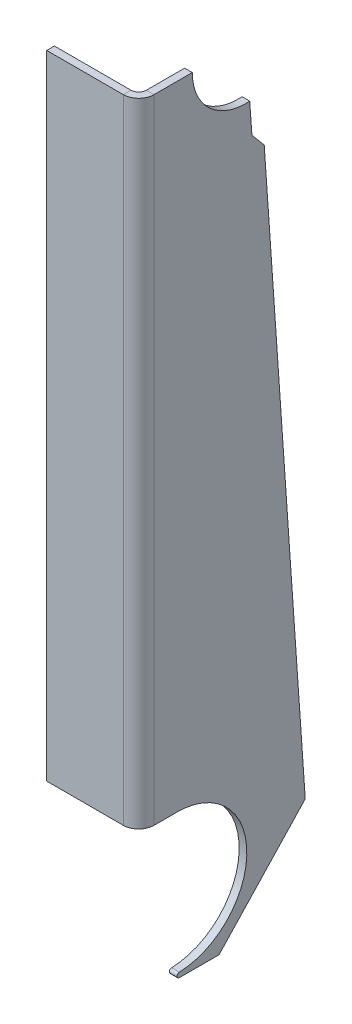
ISO-10303-21;
HEADER;
FILE_DESCRIPTION(('STEP AP214'),'2;1');
FILE_NAME('part.step','',(''),(''),'','','');
FILE_SCHEMA(('AUTOMOTIVE_DESIGN { 1 0 10303 214 1 1 1 1 }'));
ENDSEC;
DATA;
#1=APPLICATION_CONTEXT('core data for automotive mechanical design processes');
#2=APPLICATION_PROTOCOL_DEFINITION('international standard','automotive_design',2000,#1);
#3=PRODUCT_CONTEXT('',#1,'mechanical');
#4=PRODUCT('Part','Part','',(#3));
#5=PRODUCT_RELATED_PRODUCT_CATEGORY('part','',(#4));
#6=PRODUCT_DEFINITION_FORMATION('','',#4);
#7=PRODUCT_DEFINITION_CONTEXT('part definition',#1,'design');
#8=PRODUCT_DEFINITION('design','',#6,#7);
#9=PRODUCT_DEFINITION_SHAPE('','',#8);
#10=(LENGTH_UNIT() NAMED_UNIT(*) SI_UNIT(.MILLI.,.METRE.));
#11=(NAMED_UNIT(*) PLANE_ANGLE_UNIT() SI_UNIT($,.RADIAN.));
#12=(NAMED_UNIT(*) SI_UNIT($,.STERADIAN.) SOLID_ANGLE_UNIT());
#13=UNCERTAINTY_MEASURE_WITH_UNIT(LENGTH_MEASURE(1.E-05),#10,'distance_accuracy_value','');
#14=(GEOMETRIC_REPRESENTATION_CONTEXT(3) GLOBAL_UNCERTAINTY_ASSIGNED_CONTEXT((#13)) GLOBAL_UNIT_ASSIGNED_CONTEXT((#10,
#11,#12)) REPRESENTATION_CONTEXT('',''));
#15=CARTESIAN_POINT('',(0.,0.,0.));
#16=DIRECTION('',(0.,0.,1.));
#17=DIRECTION('',(1.,0.,0.));
#18=AXIS2_PLACEMENT_3D('',#15,#16,#17);
#19=CARTESIAN_POINT('',(-6.9849999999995,4.0010440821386,-33.6842795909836));
#20=CARTESIAN_POINT('',(-6.77333333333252,4.0010440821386,-33.6842795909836));
#21=CARTESIAN_POINT('',(-6.56166666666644,4.00104408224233,-33.6842795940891));
#22=CARTESIAN_POINT('',(-4.23333333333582,4.00104408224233,-33.6842795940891));
#23=CARTESIAN_POINT('',(-2.11666666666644,4.00104408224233,-33.6842795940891));
#24=CARTESIAN_POINT('',(0.211666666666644,4.00104408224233,-33.6842795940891));
#25=CARTESIAN_POINT('',(0.423333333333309,4.0010440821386,-33.6842795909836));
#26=CARTESIAN_POINT('',(0.634999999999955,4.0010440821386,-33.6842795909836));
#27=CARTESIAN_POINT('',(-6.9849999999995,3.87177828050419,-29.8141199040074));
#28=CARTESIAN_POINT('',(-6.77333333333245,3.87177828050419,-29.8141199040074));
#29=CARTESIAN_POINT('',(-6.56166666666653,3.87177828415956,-29.8141198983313));
#30=CARTESIAN_POINT('',(-4.2333333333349,3.87177828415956,-29.8141198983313));
#31=CARTESIAN_POINT('',(-2.11666666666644,3.87177828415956,-29.8141198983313));
#32=CARTESIAN_POINT('',(0.211666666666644,3.87177828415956,-29.8141198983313));
#33=CARTESIAN_POINT('',(0.423333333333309,3.87177828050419,-29.8141199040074));
#34=CARTESIAN_POINT('',(0.634999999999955,3.87177828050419,-29.8141199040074));
#35=CARTESIAN_POINT('',(-6.9849999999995,-2.24065593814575E-09,-29.8787618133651));
#36=CARTESIAN_POINT('',(-6.77333333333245,-2.24065593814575E-09,-29.8787618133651));
#37=CARTESIAN_POINT('',(-6.56166666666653,-6.50465580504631E-09,-29.8787618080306));
#38=CARTESIAN_POINT('',(-4.2333333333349,-6.50465580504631E-09,-29.8787618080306));
#39=CARTESIAN_POINT('',(-2.11666666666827,-6.50465580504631E-09,-29.8787618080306));
#40=CARTESIAN_POINT('',(0.211666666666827,-6.50465580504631E-09,-29.8787618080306));
#41=CARTESIAN_POINT('',(0.423333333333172,-2.24065593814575E-09,-29.8787618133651));
#42=CARTESIAN_POINT('',(0.634999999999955,-2.24065593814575E-09,-29.8787618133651));
#43=CARTESIAN_POINT('',(-6.9849999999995,0.,-33.7510796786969));
#44=CARTESIAN_POINT('',(-6.77333333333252,0.,-33.7510796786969));
#45=CARTESIAN_POINT('',(-6.56166666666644,0.,-33.7510796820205));
#46=CARTESIAN_POINT('',(-4.23333333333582,0.,-33.7510796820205));
#47=CARTESIAN_POINT('',(-2.11666666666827,0.,-33.7510796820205));
#48=CARTESIAN_POINT('',(0.211666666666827,0.,-33.7510796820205));
#49=CARTESIAN_POINT('',(0.423333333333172,0.,-33.7510796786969));
#50=CARTESIAN_POINT('',(0.634999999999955,0.,-33.7510796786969));
#51=(BOUNDED_SURFACE() B_SPLINE_SURFACE(3,3,((#19,#20,#21,#22,#23,#24,#25,#26),(#27,#28,#29,#30,
#31,#32,#33,#34),(#35,#36,#37,#38,#39,#40,#41,#42),(#43,#44,#45,#46,#47,#48,#49,#50)),
.UNSPECIFIED.,.F.,.F.,.F.) B_SPLINE_SURFACE_WITH_KNOTS((4,4),(4,2,2,4),(0.,1.),
(-0.099999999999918,0.,1.,1.09999999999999),
.UNSPECIFIED.) GEOMETRIC_REPRESENTATION_ITEM() RATIONAL_B_SPLINE_SURFACE(((1.,1.,1.,1.,1.,1.,1.,
1.),(0.344462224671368,0.344462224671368,0.344462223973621,0.344462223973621,0.344462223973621,
0.344462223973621,0.344462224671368,0.344462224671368),(0.344462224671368,0.344462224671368,
0.344462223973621,0.344462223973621,0.344462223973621,0.344462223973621,0.344462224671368,
0.344462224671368),(1.,1.,1.,1.,1.,1.,1.,1.))) REPRESENTATION_ITEM('') SURFACE());
#52=CARTESIAN_POINT('',(-6.9849999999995,0.,-33.7510796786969));
#53=CARTESIAN_POINT('',(-6.77333333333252,0.,-33.7510796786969));
#54=CARTESIAN_POINT('',(-6.56166666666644,0.,-33.7510796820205));
#55=CARTESIAN_POINT('',(-4.23333333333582,0.,-33.7510796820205));
#56=CARTESIAN_POINT('',(-2.11666666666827,0.,-33.7510796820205));
#57=CARTESIAN_POINT('',(0.211666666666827,0.,-33.7510796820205));
#58=CARTESIAN_POINT('',(0.423333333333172,0.,-33.7510796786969));
#59=CARTESIAN_POINT('',(0.634999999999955,0.,-33.7510796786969));
#60=(BOUNDED_CURVE() B_SPLINE_CURVE(3,(#52,#53,#54,#55,#56,#57,#58,#59),.UNSPECIFIED.,.F.,
.F.) B_SPLINE_CURVE_WITH_KNOTS((4,2,2,4),(-0.099999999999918,0.,1.,1.09999999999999),
.UNSPECIFIED.) CURVE() GEOMETRIC_REPRESENTATION_ITEM() RATIONAL_B_SPLINE_CURVE((1.,1.,1.,1.,1.,
1.,1.,1.)) REPRESENTATION_ITEM(''));
#61=CARTESIAN_POINT('',(0.,0.,-33.7510796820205));
#62=VERTEX_POINT('',#61);
#63=CARTESIAN_POINT('',(-6.35,0.,-33.7510796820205));
#64=VERTEX_POINT('',#63);
#65=EDGE_CURVE('E212',#62,#64,#60,.F.);
#66=CARTESIAN_POINT('',(0.,0.,-33.7510796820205));
#67=CARTESIAN_POINT('',(0.,-6.50465580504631E-09,-29.8787618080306));
#68=CARTESIAN_POINT('',(0.,3.87177828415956,-29.8141198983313));
#69=CARTESIAN_POINT('',(0.,4.00104408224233,-33.6842795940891));
#70=(BOUNDED_CURVE() B_SPLINE_CURVE(3,(#66,#67,#68,#69),.UNSPECIFIED.,.F.,
.F.) B_SPLINE_CURVE_WITH_KNOTS((4,4),(0.,1.),
.UNSPECIFIED.) CURVE() GEOMETRIC_REPRESENTATION_ITEM() RATIONAL_B_SPLINE_CURVE((1.,
0.344462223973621,0.344462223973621,1.)) REPRESENTATION_ITEM(''));
#71=CARTESIAN_POINT('',(0.,4.00104408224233,-33.6842795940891));
#72=VERTEX_POINT('',#71);
#73=EDGE_CURVE('E48',#72,#62,#70,.F.);
#74=CARTESIAN_POINT('',(0.634999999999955,4.0010440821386,-33.6842795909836));
#75=CARTESIAN_POINT('',(0.423333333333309,4.0010440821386,-33.6842795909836));
#76=CARTESIAN_POINT('',(0.211666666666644,4.00104408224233,-33.6842795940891));
#77=CARTESIAN_POINT('',(-2.11666666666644,4.00104408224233,-33.6842795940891));
#78=CARTESIAN_POINT('',(-4.23333333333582,4.00104408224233,-33.6842795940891));
#79=CARTESIAN_POINT('',(-6.56166666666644,4.00104408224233,-33.6842795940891));
#80=CARTESIAN_POINT('',(-6.77333333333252,4.0010440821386,-33.6842795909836));
#81=CARTESIAN_POINT('',(-6.9849999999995,4.0010440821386,-33.6842795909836));
#82=(BOUNDED_CURVE() B_SPLINE_CURVE(3,(#74,#75,#76,#77,#78,#79,#80,#81),.UNSPECIFIED.,.F.,
.F.) B_SPLINE_CURVE_WITH_KNOTS((4,2,2,4),(-0.0999999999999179,0.,1.,1.09999999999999),
.UNSPECIFIED.) CURVE() GEOMETRIC_REPRESENTATION_ITEM() RATIONAL_B_SPLINE_CURVE((1.,1.,1.,1.,1.,
1.,1.,1.)) REPRESENTATION_ITEM(''));
#83=CARTESIAN_POINT('',(-6.34999999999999,4.00104408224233,-33.6842795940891));
#84=VERTEX_POINT('',#83);
#85=EDGE_CURVE('E254',#84,#72,#82,.F.);
#86=CARTESIAN_POINT('',(-6.35,4.00104408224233,-33.6842795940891));
#87=CARTESIAN_POINT('',(-6.35,3.87177828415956,-29.8141198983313));
#88=CARTESIAN_POINT('',(-6.35,-6.5046558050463E-09,-29.8787618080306));
#89=CARTESIAN_POINT('',(-6.35,0.,-33.7510796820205));
#90=(BOUNDED_CURVE() B_SPLINE_CURVE(3,(#86,#87,#88,#89),.UNSPECIFIED.,.F.,
.F.) B_SPLINE_CURVE_WITH_KNOTS((4,4),(0.,1.),
.UNSPECIFIED.) CURVE() GEOMETRIC_REPRESENTATION_ITEM() RATIONAL_B_SPLINE_CURVE((1.,
0.344462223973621,0.344462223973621,1.)) REPRESENTATION_ITEM(''));
#91=EDGE_CURVE('E11',#64,#84,#90,.F.);
#92=ORIENTED_EDGE('',*,*,#65,.F.);
#93=ORIENTED_EDGE('',*,*,#73,.F.);
#94=ORIENTED_EDGE('',*,*,#85,.F.);
#95=ORIENTED_EDGE('',*,*,#91,.F.);
#96=EDGE_LOOP('',(#92,#93,#94,#95));
#97=FACE_BOUND('',#96,.T.);
#98=ADVANCED_FACE('F36',(#97),#51,.T.);
#99=CARTESIAN_POINT('',(0.,644.525,0.));
#100=DIRECTION('',(-1.,0.,0.));
#101=DIRECTION('',(0.,0.,1.));
#102=AXIS2_PLACEMENT_3D('',#99,#100,#101);
#103=PLANE('',#102);
#104=CARTESIAN_POINT('',(0.,61.9125,-31.7499999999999));
#105=DIRECTION('',(-1.,0.,0.));
#106=DIRECTION('',(0.,0.,1.));
#107=AXIS2_PLACEMENT_3D('',#104,#105,#106);
#108=CIRCLE('',#107,57.94375);
#109=CARTESIAN_POINT('',(0.,119.85625,-31.7499999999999));
#110=VERTEX_POINT('',#109);
#111=EDGE_CURVE('E217',#110,#72,#108,.T.);
#112=ORIENTED_EDGE('',*,*,#111,.T.);
#113=ORIENTED_EDGE('',*,*,#73,.T.);
#114=DIRECTION('',(0.,0.,-1.));
#115=VECTOR('',#114,1.);
#116=CARTESIAN_POINT('',(0.,0.,0.));
#117=LINE('',#116,#115);
#118=CARTESIAN_POINT('',(0.,0.,-66.675));
#119=VERTEX_POINT('',#118);
#120=EDGE_CURVE('E178',#62,#119,#117,.T.);
#121=ORIENTED_EDGE('',*,*,#120,.T.);
#122=DIRECTION('',(0.,0.729537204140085,-0.68394112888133));
#123=VECTOR('',#122,1.);
#124=CARTESIAN_POINT('',(0.,309.763825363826,-357.078586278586));
#125=LINE('',#124,#123);
#126=CARTESIAN_POINT('',(0.,76.1999999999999,-138.1125));
#127=VERTEX_POINT('',#126);
#128=EDGE_CURVE('E263',#119,#127,#125,.T.);
#129=ORIENTED_EDGE('',*,*,#128,.T.);
#130=DIRECTION('',(0.,0.997564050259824,0.0697564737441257));
#131=VECTOR('',#130,1.);
#132=CARTESIAN_POINT('',(0.,651.37032253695,-97.8926730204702));
#133=LINE('',#132,#131);
#134=CARTESIAN_POINT('',(0.,562.6924678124,-104.093632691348));
#135=VERTEX_POINT('',#134);
#136=EDGE_CURVE('E279',#127,#135,#133,.T.);
#137=ORIENTED_EDGE('',*,*,#136,.T.);
#138=DIRECTION('',(0.,0.766044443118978,0.642787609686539));
#139=VECTOR('',#138,1.);
#140=CARTESIAN_POINT('',(0.,661.969877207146,-20.7899950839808));
#141=LINE('',#140,#139);
#142=CARTESIAN_POINT('',(0.,574.853423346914,-93.8893793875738));
#143=VERTEX_POINT('',#142);
#144=EDGE_CURVE('E277',#135,#143,#141,.T.);
#145=ORIENTED_EDGE('',*,*,#144,.T.);
#146=DIRECTION('',(0.,0.997445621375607,0.0714299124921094));
#147=VECTOR('',#146,1.);
#148=CARTESIAN_POINT('',(0.,650.858898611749,-88.4464115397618));
#149=LINE('',#148,#147);
#150=CARTESIAN_POINT('',(0.,600.188542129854,-92.0750596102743));
#151=VERTEX_POINT('',#150);
#152=EDGE_CURVE('E168',#143,#151,#149,.T.);
#153=ORIENTED_EDGE('',*,*,#152,.T.);
#154=CARTESIAN_POINT('',(0.,644.525,-88.9));
#155=DIRECTION('',(-1.,0.,0.));
#156=DIRECTION('',(0.,0.,1.));
#157=AXIS2_PLACEMENT_3D('',#154,#155,#156);
#158=CIRCLE('',#157,44.45);
#159=CARTESIAN_POINT('',(0.,644.525,-44.45));
#160=VERTEX_POINT('',#159);
#161=EDGE_CURVE('E149',#151,#160,#158,.T.);
#162=ORIENTED_EDGE('',*,*,#161,.T.);
#163=DIRECTION('',(0.,0.,-1.));
#164=VECTOR('',#163,1.);
#165=CARTESIAN_POINT('',(0.,644.525,0.));
#166=LINE('',#165,#164);
#167=CARTESIAN_POINT('',(0.,644.525,-12.7));
#168=VERTEX_POINT('',#167);
#169=EDGE_CURVE('E166',#168,#160,#166,.T.);
#170=ORIENTED_EDGE('',*,*,#169,.F.);
#171=DIRECTION('',(0.,-1.,0.));
#172=VECTOR('',#171,1.);
#173=CARTESIAN_POINT('',(0.,644.525,-12.7));
#174=LINE('',#173,#172);
#175=CARTESIAN_POINT('',(0.,119.85625,-12.7));
#176=VERTEX_POINT('',#175);
#177=EDGE_CURVE('E197',#168,#176,#174,.T.);
#178=ORIENTED_EDGE('',*,*,#177,.T.);
#179=DIRECTION('',(0.,0.,1.));
#180=VECTOR('',#179,1.);
#181=CARTESIAN_POINT('',(0.,119.85625,-31.7499999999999));
#182=LINE('',#181,#180);
#183=EDGE_CURVE('E157',#110,#176,#182,.T.);
#184=ORIENTED_EDGE('',*,*,#183,.F.);
#185=EDGE_LOOP('',(#112,#113,#121,#129,#137,#145,#153,#162,#170,#178,#184));
#186=FACE_BOUND('',#185,.T.);
#187=ADVANCED_FACE('F164',(#186),#103,.F.);
#188=CARTESIAN_POINT('',(-6.35,644.525,0.));
#189=DIRECTION('',(-1.,0.,0.));
#190=DIRECTION('',(0.,0.,1.));
#191=AXIS2_PLACEMENT_3D('',#188,#189,#190);
#192=PLANE('',#191);
#193=DIRECTION('',(0.,0.,-1.));
#194=VECTOR('',#193,1.);
#195=CARTESIAN_POINT('',(-6.35,0.,0.));
#196=LINE('',#195,#194);
#197=CARTESIAN_POINT('',(-6.35000000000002,0.,-66.675));
#198=VERTEX_POINT('',#197);
#199=EDGE_CURVE('E174',#64,#198,#196,.T.);
#200=ORIENTED_EDGE('',*,*,#199,.F.);
#201=ORIENTED_EDGE('',*,*,#91,.T.);
#202=CARTESIAN_POINT('',(-6.34999999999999,61.9125,-31.7499999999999));
#203=DIRECTION('',(-1.,0.,0.));
#204=DIRECTION('',(0.,0.,1.));
#205=AXIS2_PLACEMENT_3D('',#202,#203,#204);
#206=CIRCLE('',#205,57.94375);
#207=CARTESIAN_POINT('',(-6.34999999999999,119.85625,-31.7499999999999));
#208=VERTEX_POINT('',#207);
#209=EDGE_CURVE('E319',#208,#84,#206,.T.);
#210=ORIENTED_EDGE('',*,*,#209,.F.);
#211=DIRECTION('',(0.,0.,-1.));
#212=VECTOR('',#211,1.);
#213=CARTESIAN_POINT('',(-6.35,119.85625,0.));
#214=LINE('',#213,#212);
#215=CARTESIAN_POINT('',(-6.35000000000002,119.85625,-12.7));
#216=VERTEX_POINT('',#215);
#217=EDGE_CURVE('E318',#216,#208,#214,.T.);
#218=ORIENTED_EDGE('',*,*,#217,.F.);
#219=DIRECTION('',(0.,-1.,0.));
#220=VECTOR('',#219,1.);
#221=CARTESIAN_POINT('',(-6.35,644.525,-12.7));
#222=LINE('',#221,#220);
#223=CARTESIAN_POINT('',(-6.35,644.525,-12.7));
#224=VERTEX_POINT('',#223);
#225=EDGE_CURVE('E537',#224,#216,#222,.T.);
#226=ORIENTED_EDGE('',*,*,#225,.F.);
#227=DIRECTION('',(0.,0.,-1.));
#228=VECTOR('',#227,1.);
#229=CARTESIAN_POINT('',(-6.35,644.525,0.));
#230=LINE('',#229,#228);
#231=CARTESIAN_POINT('',(-6.34999999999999,644.525,-44.45));
#232=VERTEX_POINT('',#231);
#233=EDGE_CURVE('E173',#224,#232,#230,.T.);
#234=ORIENTED_EDGE('',*,*,#233,.T.);
#235=CARTESIAN_POINT('',(-6.34999999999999,644.525,-88.9));
#236=DIRECTION('',(-1.,0.,0.));
#237=DIRECTION('',(0.,0.,1.));
#238=AXIS2_PLACEMENT_3D('',#235,#236,#237);
#239=CIRCLE('',#238,44.45);
#240=CARTESIAN_POINT('',(-6.35,600.188542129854,-92.0750596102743));
#241=VERTEX_POINT('',#240);
#242=EDGE_CURVE('E152',#241,#232,#239,.T.);
#243=ORIENTED_EDGE('',*,*,#242,.F.);
#244=DIRECTION('',(0.,0.997445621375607,0.0714299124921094));
#245=VECTOR('',#244,1.);
#246=CARTESIAN_POINT('',(-6.35,650.858898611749,-88.4464115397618));
#247=LINE('',#246,#245);
#248=CARTESIAN_POINT('',(-6.35000000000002,574.853423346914,-93.8893793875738));
#249=VERTEX_POINT('',#248);
#250=EDGE_CURVE('E281',#249,#241,#247,.T.);
#251=ORIENTED_EDGE('',*,*,#250,.F.);
#252=DIRECTION('',(0.,0.766044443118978,0.642787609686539));
#253=VECTOR('',#252,1.);
#254=CARTESIAN_POINT('',(-6.35,661.969877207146,-20.7899950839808));
#255=LINE('',#254,#253);
#256=CARTESIAN_POINT('',(-6.35000000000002,562.6924678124,-104.093632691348));
#257=VERTEX_POINT('',#256);
#258=EDGE_CURVE('E283',#257,#249,#255,.T.);
#259=ORIENTED_EDGE('',*,*,#258,.F.);
#260=DIRECTION('',(0.,0.997564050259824,0.0697564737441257));
#261=VECTOR('',#260,1.);
#262=CARTESIAN_POINT('',(-6.35,651.37032253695,-97.8926730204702));
#263=LINE('',#262,#261);
#264=CARTESIAN_POINT('',(-6.35000000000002,76.2,-138.1125));
#265=VERTEX_POINT('',#264);
#266=EDGE_CURVE('E272',#265,#257,#263,.T.);
#267=ORIENTED_EDGE('',*,*,#266,.F.);
#268=DIRECTION('',(0.,0.729537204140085,-0.68394112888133));
#269=VECTOR('',#268,1.);
#270=CARTESIAN_POINT('',(-6.35,309.763825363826,-357.078586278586));
#271=LINE('',#270,#269);
#272=EDGE_CURVE('E270',#198,#265,#271,.T.);
#273=ORIENTED_EDGE('',*,*,#272,.F.);
#274=EDGE_LOOP('',(#200,#201,#210,#218,#226,#234,#243,#251,#259,#267,#273));
#275=FACE_BOUND('',#274,.T.);
#276=ADVANCED_FACE('F252',(#275),#192,.T.);
#277=CARTESIAN_POINT('',(-12.7,644.525,-12.7));
#278=DIRECTION('',(0.,1.,0.));
#279=DIRECTION('',(1.,0.,0.));
#280=AXIS2_PLACEMENT_3D('',#277,#278,#279);
#281=PLANE('',#280);
#282=ORIENTED_EDGE('',*,*,#169,.T.);
#283=DIRECTION('',(-1.,0.,0.));
#284=VECTOR('',#283,1.);
#285=CARTESIAN_POINT('',(-6.34999999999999,644.525,-44.45));
#286=LINE('',#285,#284);
#287=EDGE_CURVE('E146',#232,#160,#286,.F.);
#288=ORIENTED_EDGE('',*,*,#287,.F.);
#289=ORIENTED_EDGE('',*,*,#233,.F.);
#290=DIRECTION('',(1.,0.,0.));
#291=VECTOR('',#290,1.);
#292=CARTESIAN_POINT('',(-6.35,644.525,-12.7));
#293=LINE('',#292,#291);
#294=EDGE_CURVE('E171',#224,#168,#293,.T.);
#295=ORIENTED_EDGE('',*,*,#294,.T.);
#296=EDGE_LOOP('',(#282,#288,#289,#295));
#297=FACE_BOUND('',#296,.T.);
#298=ADVANCED_FACE('F170',(#297),#281,.T.);
#299=CARTESIAN_POINT('',(-6.35,650.858898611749,-88.4464115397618));
#300=DIRECTION('',(0.,-0.0714299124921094,0.997445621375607));
#301=DIRECTION('',(0.,0.997445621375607,0.0714299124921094));
#302=AXIS2_PLACEMENT_3D('',#299,#300,#301);
#303=PLANE('',#302);
#304=ORIENTED_EDGE('',*,*,#250,.T.);
#305=DIRECTION('',(-1.,0.,0.));
#306=VECTOR('',#305,1.);
#307=CARTESIAN_POINT('',(-6.35,600.188542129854,-92.0750596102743));
#308=LINE('',#307,#306);
#309=EDGE_CURVE('E158',#241,#151,#308,.F.);
#310=ORIENTED_EDGE('',*,*,#309,.T.);
#311=ORIENTED_EDGE('',*,*,#152,.F.);
#312=DIRECTION('',(-1.,0.,0.));
#313=VECTOR('',#312,1.);
#314=CARTESIAN_POINT('',(-6.35000000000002,574.853423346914,-93.8893793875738));
#315=LINE('',#314,#313);
#316=EDGE_CURVE('E287',#249,#143,#315,.F.);
#317=ORIENTED_EDGE('',*,*,#316,.F.);
#318=EDGE_LOOP('',(#304,#310,#311,#317));
#319=FACE_BOUND('',#318,.T.);
#320=ADVANCED_FACE('F299',(#319),#303,.F.);
#321=CARTESIAN_POINT('',(-6.34999999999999,61.9125,-31.7499999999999));
#322=DIRECTION('',(-1.,0.,0.));
#323=DIRECTION('',(0.,0.,1.));
#324=AXIS2_PLACEMENT_3D('',#321,#322,#323);
#325=CYLINDRICAL_SURFACE('',#324,57.94375);
#326=ORIENTED_EDGE('',*,*,#209,.T.);
#327=ORIENTED_EDGE('',*,*,#85,.T.);
#328=ORIENTED_EDGE('',*,*,#111,.F.);
#329=DIRECTION('',(-1.,0.,0.));
#330=VECTOR('',#329,1.);
#331=CARTESIAN_POINT('',(-6.34999999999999,119.85625,-31.7499999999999));
#332=LINE('',#331,#330);
#333=EDGE_CURVE('E205',#110,#208,#332,.T.);
#334=ORIENTED_EDGE('',*,*,#333,.T.);
#335=EDGE_LOOP('',(#326,#327,#328,#334));
#336=FACE_BOUND('',#335,.T.);
#337=ADVANCED_FACE('F231',(#336),#325,.F.);
#338=CARTESIAN_POINT('',(-12.7,0.,-6.35));
#339=DIRECTION('',(0.,-1.,0.));
#340=DIRECTION('',(0.,0.,-1.));
#341=AXIS2_PLACEMENT_3D('',#338,#339,#340);
#342=PLANE('',#341);
#343=ORIENTED_EDGE('',*,*,#120,.F.);
#344=ORIENTED_EDGE('',*,*,#65,.T.);
#345=ORIENTED_EDGE('',*,*,#199,.T.);
#346=DIRECTION('',(-1.,0.,0.));
#347=VECTOR('',#346,1.);
#348=CARTESIAN_POINT('',(-6.35000000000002,0.,-66.675));
#349=LINE('',#348,#347);
#350=EDGE_CURVE('E259',#198,#119,#349,.F.);
#351=ORIENTED_EDGE('',*,*,#350,.T.);
#352=EDGE_LOOP('',(#343,#344,#345,#351));
#353=FACE_BOUND('',#352,.T.);
#354=ADVANCED_FACE('F220',(#353),#342,.T.);
#355=CARTESIAN_POINT('',(-12.7,644.525,-12.7));
#356=DIRECTION('',(0.,-1.,0.));
#357=DIRECTION('',(0.,0.,-1.));
#358=AXIS2_PLACEMENT_3D('',#355,#356,#357);
#359=CYLINDRICAL_SURFACE('',#358,6.35);
#360=CARTESIAN_POINT('',(-12.7,119.85625,-12.7));
#361=DIRECTION('',(0.,1.,0.));
#362=DIRECTION('',(0.,0.,1.));
#363=AXIS2_PLACEMENT_3D('',#360,#361,#362);
#364=CIRCLE('',#363,6.35);
#365=CARTESIAN_POINT('',(-12.7,119.85625,-6.35));
#366=VERTEX_POINT('',#365);
#367=EDGE_CURVE('E316',#366,#216,#364,.T.);
#368=ORIENTED_EDGE('',*,*,#367,.F.);
#369=DIRECTION('',(0.,-1.,0.));
#370=VECTOR('',#369,1.);
#371=CARTESIAN_POINT('',(-12.7,644.525,-6.35));
#372=LINE('',#371,#370);
#373=CARTESIAN_POINT('',(-12.7,644.525,-6.35));
#374=VERTEX_POINT('',#373);
#375=EDGE_CURVE('E541',#374,#366,#372,.T.);
#376=ORIENTED_EDGE('',*,*,#375,.F.);
#377=CARTESIAN_POINT('',(-12.7,644.525,-12.7));
#378=DIRECTION('',(0.,1.,0.));
#379=DIRECTION('',(1.,0.,0.));
#380=AXIS2_PLACEMENT_3D('',#377,#378,#379);
#381=CIRCLE('',#380,6.35);
#382=EDGE_CURVE('E176',#374,#224,#381,.T.);
#383=ORIENTED_EDGE('',*,*,#382,.T.);
#384=ORIENTED_EDGE('',*,*,#225,.T.);
#385=EDGE_LOOP('',(#368,#376,#383,#384));
#386=FACE_BOUND('',#385,.T.);
#387=ADVANCED_FACE('F230',(#386),#359,.F.);
#388=CARTESIAN_POINT('',(-76.2,644.525,-6.35));
#389=DIRECTION('',(0.,0.,-1.));
#390=DIRECTION('',(-1.,0.,0.));
#391=AXIS2_PLACEMENT_3D('',#388,#389,#390);
#392=PLANE('',#391);
#393=DIRECTION('',(1.,0.,0.));
#394=VECTOR('',#393,1.);
#395=CARTESIAN_POINT('',(-76.2,119.85625,-6.35));
#396=LINE('',#395,#394);
#397=CARTESIAN_POINT('',(-76.2,119.85625,-6.35));
#398=VERTEX_POINT('',#397);
#399=EDGE_CURVE('E314',#398,#366,#396,.T.);
#400=ORIENTED_EDGE('',*,*,#399,.F.);
#401=DIRECTION('',(0.,-1.,0.));
#402=VECTOR('',#401,1.);
#403=CARTESIAN_POINT('',(-76.2,644.525,-6.35));
#404=LINE('',#403,#402);
#405=CARTESIAN_POINT('',(-76.2,644.525,-6.35));
#406=VERTEX_POINT('',#405);
#407=EDGE_CURVE('E544',#406,#398,#404,.T.);
#408=ORIENTED_EDGE('',*,*,#407,.F.);
#409=DIRECTION('',(1.,0.,0.));
#410=VECTOR('',#409,1.);
#411=CARTESIAN_POINT('',(-76.2,644.525,-6.35));
#412=LINE('',#411,#410);
#413=EDGE_CURVE('E186',#406,#374,#412,.T.);
#414=ORIENTED_EDGE('',*,*,#413,.T.);
#415=ORIENTED_EDGE('',*,*,#375,.T.);
#416=EDGE_LOOP('',(#400,#408,#414,#415));
#417=FACE_BOUND('',#416,.T.);
#418=ADVANCED_FACE('F359',(#417),#392,.T.);
#419=CARTESIAN_POINT('',(-76.2,644.525,0.));
#420=DIRECTION('',(-1.,0.,0.));
#421=DIRECTION('',(0.,0.,1.));
#422=AXIS2_PLACEMENT_3D('',#419,#420,#421);
#423=PLANE('',#422);
#424=DIRECTION('',(0.,0.,1.));
#425=VECTOR('',#424,1.);
#426=CARTESIAN_POINT('',(-76.2,119.85625,-31.7499999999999));
#427=LINE('',#426,#425);
#428=CARTESIAN_POINT('',(-76.2,119.85625,0.));
#429=VERTEX_POINT('',#428);
#430=EDGE_CURVE('E304',#398,#429,#427,.T.);
#431=ORIENTED_EDGE('',*,*,#430,.T.);
#432=DIRECTION('',(0.,-1.,0.));
#433=VECTOR('',#432,1.);
#434=CARTESIAN_POINT('',(-76.2,644.525,0.));
#435=LINE('',#434,#433);
#436=CARTESIAN_POINT('',(-76.2,644.525,0.));
#437=VERTEX_POINT('',#436);
#438=EDGE_CURVE('E547',#437,#429,#435,.T.);
#439=ORIENTED_EDGE('',*,*,#438,.F.);
#440=DIRECTION('',(0.,0.,-1.));
#441=VECTOR('',#440,1.);
#442=CARTESIAN_POINT('',(-76.2,644.525,0.));
#443=LINE('',#442,#441);
#444=EDGE_CURVE('E189',#437,#406,#443,.T.);
#445=ORIENTED_EDGE('',*,*,#444,.T.);
#446=ORIENTED_EDGE('',*,*,#407,.T.);
#447=EDGE_LOOP('',(#431,#439,#445,#446));
#448=FACE_BOUND('',#447,.T.);
#449=ADVANCED_FACE('F355',(#448),#423,.T.);
#450=CARTESIAN_POINT('',(-76.2,644.525,0.));
#451=DIRECTION('',(0.,0.,-1.));
#452=DIRECTION('',(-1.,0.,0.));
#453=AXIS2_PLACEMENT_3D('',#450,#451,#452);
#454=PLANE('',#453);
#455=ORIENTED_EDGE('',*,*,#438,.T.);
#456=DIRECTION('',(1.,0.,0.));
#457=VECTOR('',#456,1.);
#458=CARTESIAN_POINT('',(-76.2,119.85625,0.));
#459=LINE('',#458,#457);
#460=CARTESIAN_POINT('',(-12.7,119.85625,0.));
#461=VERTEX_POINT('',#460);
#462=EDGE_CURVE('E311',#429,#461,#459,.T.);
#463=ORIENTED_EDGE('',*,*,#462,.T.);
#464=DIRECTION('',(0.,-1.,0.));
#465=VECTOR('',#464,1.);
#466=CARTESIAN_POINT('',(-12.7000000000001,644.525,0.));
#467=LINE('',#466,#465);
#468=CARTESIAN_POINT('',(-12.7000000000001,644.525,0.));
#469=VERTEX_POINT('',#468);
#470=EDGE_CURVE('E550',#469,#461,#467,.T.);
#471=ORIENTED_EDGE('',*,*,#470,.F.);
#472=DIRECTION('',(1.,0.,0.));
#473=VECTOR('',#472,1.);
#474=CARTESIAN_POINT('',(-76.2,644.525,0.));
#475=LINE('',#474,#473);
#476=EDGE_CURVE('E192',#437,#469,#475,.T.);
#477=ORIENTED_EDGE('',*,*,#476,.F.);
#478=EDGE_LOOP('',(#455,#463,#471,#477));
#479=FACE_BOUND('',#478,.T.);
#480=ADVANCED_FACE('F245',(#479),#454,.F.);
#481=CARTESIAN_POINT('',(-12.7,644.525,-12.7));
#482=DIRECTION('',(0.,-1.,0.));
#483=DIRECTION('',(0.,0.,-1.));
#484=AXIS2_PLACEMENT_3D('',#481,#482,#483);
#485=CYLINDRICAL_SURFACE('',#484,12.7);
#486=ORIENTED_EDGE('',*,*,#470,.T.);
#487=CARTESIAN_POINT('',(-12.7,119.85625,-12.7));
#488=DIRECTION('',(0.,1.,0.));
#489=DIRECTION('',(0.,0.,1.));
#490=AXIS2_PLACEMENT_3D('',#487,#488,#489);
#491=CIRCLE('',#490,12.7);
#492=EDGE_CURVE('E307',#461,#176,#491,.T.);
#493=ORIENTED_EDGE('',*,*,#492,.T.);
#494=ORIENTED_EDGE('',*,*,#177,.F.);
#495=CARTESIAN_POINT('',(-12.7,644.525,-12.7));
#496=DIRECTION('',(0.,-1.,0.));
#497=DIRECTION('',(0.,0.,-1.));
#498=AXIS2_PLACEMENT_3D('',#495,#496,#497);
#499=CIRCLE('',#498,12.7);
#500=EDGE_CURVE('E195',#469,#168,#499,.F.);
#501=ORIENTED_EDGE('',*,*,#500,.F.);
#502=EDGE_LOOP('',(#486,#493,#494,#501));
#503=FACE_BOUND('',#502,.T.);
#504=ADVANCED_FACE('F240',(#503),#485,.T.);
#505=CARTESIAN_POINT('',(-12.7000000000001,644.525,0.));
#506=DIRECTION('',(0.,1.,0.));
#507=DIRECTION('',(0.,0.,1.));
#508=AXIS2_PLACEMENT_3D('',#505,#506,#507);
#509=PLANE('',#508);
#510=DIRECTION('',(0.,0.,-1.));
#511=VECTOR('',#510,1.);
#512=CARTESIAN_POINT('',(-12.7000000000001,644.525,0.));
#513=LINE('',#512,#511);
#514=EDGE_CURVE('E534',#469,#374,#513,.T.);
#515=ORIENTED_EDGE('',*,*,#514,.F.);
#516=ORIENTED_EDGE('',*,*,#500,.T.);
#517=ORIENTED_EDGE('',*,*,#294,.F.);
#518=ORIENTED_EDGE('',*,*,#382,.F.);
#519=EDGE_LOOP('',(#515,#516,#517,#518));
#520=FACE_BOUND('',#519,.T.);
#521=ADVANCED_FACE('F237',(#520),#509,.T.);
#522=CARTESIAN_POINT('',(-6.35,644.525,-12.7));
#523=DIRECTION('',(0.,1.,0.));
#524=DIRECTION('',(0.,0.,1.));
#525=AXIS2_PLACEMENT_3D('',#522,#523,#524);
#526=PLANE('',#525);
#527=ORIENTED_EDGE('',*,*,#476,.T.);
#528=ORIENTED_EDGE('',*,*,#514,.T.);
#529=ORIENTED_EDGE('',*,*,#413,.F.);
#530=ORIENTED_EDGE('',*,*,#444,.F.);
#531=EDGE_LOOP('',(#527,#528,#529,#530));
#532=FACE_BOUND('',#531,.T.);
#533=ADVANCED_FACE('F234',(#532),#526,.T.);
#534=CARTESIAN_POINT('',(-6.35,661.969877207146,-20.7899950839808));
#535=DIRECTION('',(0.,-0.642787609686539,0.766044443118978));
#536=DIRECTION('',(0.,0.766044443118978,0.642787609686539));
#537=AXIS2_PLACEMENT_3D('',#534,#535,#536);
#538=PLANE('',#537);
#539=DIRECTION('',(-1.,0.,0.));
#540=VECTOR('',#539,1.);
#541=CARTESIAN_POINT('',(-6.35000000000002,562.6924678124,-104.093632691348));
#542=LINE('',#541,#540);
#543=EDGE_CURVE('E204',#257,#135,#542,.F.);
#544=ORIENTED_EDGE('',*,*,#543,.F.);
#545=ORIENTED_EDGE('',*,*,#258,.T.);
#546=ORIENTED_EDGE('',*,*,#316,.T.);
#547=ORIENTED_EDGE('',*,*,#144,.F.);
#548=EDGE_LOOP('',(#544,#545,#546,#547));
#549=FACE_BOUND('',#548,.T.);
#550=ADVANCED_FACE('F236',(#549),#538,.F.);
#551=CARTESIAN_POINT('',(-6.35,651.37032253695,-97.8926730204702));
#552=DIRECTION('',(0.,-0.0697564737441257,0.997564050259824));
#553=DIRECTION('',(0.,0.997564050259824,0.0697564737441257));
#554=AXIS2_PLACEMENT_3D('',#551,#552,#553);
#555=PLANE('',#554);
#556=ORIENTED_EDGE('',*,*,#266,.T.);
#557=ORIENTED_EDGE('',*,*,#543,.T.);
#558=ORIENTED_EDGE('',*,*,#136,.F.);
#559=DIRECTION('',(-1.,0.,0.));
#560=VECTOR('',#559,1.);
#561=CARTESIAN_POINT('',(-6.35000000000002,76.2,-138.1125));
#562=LINE('',#561,#560);
#563=EDGE_CURVE('E181',#265,#127,#562,.F.);
#564=ORIENTED_EDGE('',*,*,#563,.F.);
#565=EDGE_LOOP('',(#556,#557,#558,#564));
#566=FACE_BOUND('',#565,.T.);
#567=ADVANCED_FACE('F292',(#566),#555,.F.);
#568=CARTESIAN_POINT('',(-6.35,309.763825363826,-357.078586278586));
#569=DIRECTION('',(0.,0.68394112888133,0.729537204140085));
#570=DIRECTION('',(0.,0.729537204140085,-0.68394112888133));
#571=AXIS2_PLACEMENT_3D('',#568,#569,#570);
#572=PLANE('',#571);
#573=ORIENTED_EDGE('',*,*,#272,.T.);
#574=ORIENTED_EDGE('',*,*,#563,.T.);
#575=ORIENTED_EDGE('',*,*,#128,.F.);
#576=ORIENTED_EDGE('',*,*,#350,.F.);
#577=EDGE_LOOP('',(#573,#574,#575,#576));
#578=FACE_BOUND('',#577,.T.);
#579=ADVANCED_FACE('F267',(#578),#572,.F.);
#580=CARTESIAN_POINT('',(-76.2,119.85625,-31.7499999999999));
#581=DIRECTION('',(0.,1.,0.));
#582=DIRECTION('',(0.,0.,1.));
#583=AXIS2_PLACEMENT_3D('',#580,#581,#582);
#584=PLANE('',#583);
#585=ORIENTED_EDGE('',*,*,#217,.T.);
#586=ORIENTED_EDGE('',*,*,#333,.F.);
#587=ORIENTED_EDGE('',*,*,#183,.T.);
#588=ORIENTED_EDGE('',*,*,#492,.F.);
#589=ORIENTED_EDGE('',*,*,#462,.F.);
#590=ORIENTED_EDGE('',*,*,#430,.F.);
#591=ORIENTED_EDGE('',*,*,#399,.T.);
#592=ORIENTED_EDGE('',*,*,#367,.T.);
#593=EDGE_LOOP('',(#585,#586,#587,#588,#589,#590,#591,#592));
#594=FACE_BOUND('',#593,.T.);
#595=ADVANCED_FACE('F341',(#594),#584,.F.);
#596=CARTESIAN_POINT('',(-6.34999999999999,644.525,-88.9));
#597=DIRECTION('',(-1.,0.,0.));
#598=DIRECTION('',(0.,0.,1.));
#599=AXIS2_PLACEMENT_3D('',#596,#597,#598);
#600=CYLINDRICAL_SURFACE('',#599,44.45);
#601=ORIENTED_EDGE('',*,*,#242,.T.);
#602=ORIENTED_EDGE('',*,*,#287,.T.);
#603=ORIENTED_EDGE('',*,*,#161,.F.);
#604=ORIENTED_EDGE('',*,*,#309,.F.);
#605=EDGE_LOOP('',(#601,#602,#603,#604));
#606=FACE_BOUND('',#605,.T.);
#607=ADVANCED_FACE('F148',(#606),#600,.F.);
#608=CLOSED_SHELL('',(#98,#187,#276,#298,#320,#337,#354,#387,#418,#449,#480,#504,#521,#533,#550,
#567,#579,#595,#607));
#609=MANIFOLD_SOLID_BREP('B2',#608);
#610=ADVANCED_BREP_SHAPE_REPRESENTATION('',(#18,#609),#14);
#611=SHAPE_DEFINITION_REPRESENTATION(#9,#610);
ENDSEC;
END-ISO-10303-21;
